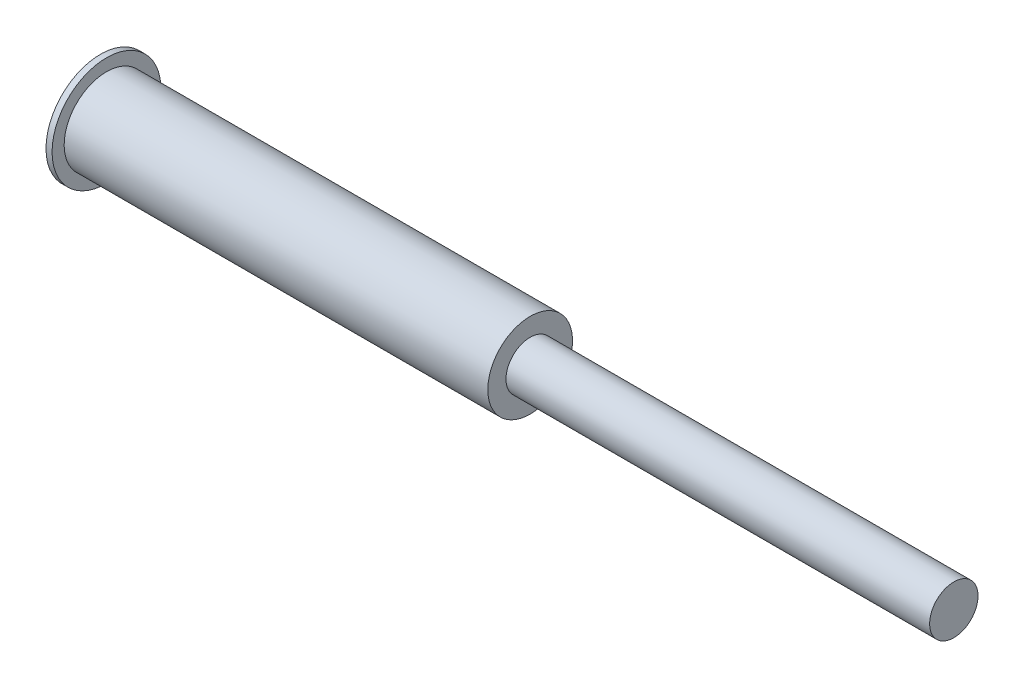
ISO-10303-21;
HEADER;
FILE_DESCRIPTION(('STEP AP214'),'2;1');
FILE_NAME('part.step','',(''),(''),'','','');
FILE_SCHEMA(('AUTOMOTIVE_DESIGN { 1 0 10303 214 1 1 1 1 }'));
ENDSEC;
DATA;
#1=APPLICATION_CONTEXT('core data for automotive mechanical design processes');
#2=APPLICATION_PROTOCOL_DEFINITION('international standard','automotive_design',2000,#1);
#3=PRODUCT_CONTEXT('',#1,'mechanical');
#4=PRODUCT('Part','Part','',(#3));
#5=PRODUCT_RELATED_PRODUCT_CATEGORY('part','',(#4));
#6=PRODUCT_DEFINITION_FORMATION('','',#4);
#7=PRODUCT_DEFINITION_CONTEXT('part definition',#1,'design');
#8=PRODUCT_DEFINITION('design','',#6,#7);
#9=PRODUCT_DEFINITION_SHAPE('','',#8);
#10=(LENGTH_UNIT() NAMED_UNIT(*) SI_UNIT(.MILLI.,.METRE.));
#11=(NAMED_UNIT(*) PLANE_ANGLE_UNIT() SI_UNIT($,.RADIAN.));
#12=(NAMED_UNIT(*) SI_UNIT($,.STERADIAN.) SOLID_ANGLE_UNIT());
#13=UNCERTAINTY_MEASURE_WITH_UNIT(LENGTH_MEASURE(1.E-05),#10,'distance_accuracy_value','');
#14=(GEOMETRIC_REPRESENTATION_CONTEXT(3) GLOBAL_UNCERTAINTY_ASSIGNED_CONTEXT((#13)) GLOBAL_UNIT_ASSIGNED_CONTEXT((#10,
#11,#12)) REPRESENTATION_CONTEXT('',''));
#15=CARTESIAN_POINT('',(0.,0.,0.));
#16=DIRECTION('',(0.,0.,1.));
#17=DIRECTION('',(1.,0.,0.));
#18=AXIS2_PLACEMENT_3D('',#15,#16,#17);
#19=CARTESIAN_POINT('',(0.,4.5,0.));
#20=DIRECTION('',(1.,0.,0.));
#21=DIRECTION('',(0.,0.,-1.));
#22=AXIS2_PLACEMENT_3D('',#19,#20,#21);
#23=PLANE('',#22);
#24=CARTESIAN_POINT('',(0.,0.,0.));
#25=DIRECTION('',(-1.,0.,0.));
#26=DIRECTION('',(0.,0.,1.));
#27=AXIS2_PLACEMENT_3D('',#24,#25,#26);
#28=CIRCLE('',#27,4.5);
#29=CARTESIAN_POINT('',(0.,0.,4.5));
#30=VERTEX_POINT('',#29);
#31=EDGE_CURVE('E10',#30,#30,#28,.T.);
#32=ORIENTED_EDGE('',*,*,#31,.T.);
#33=EDGE_LOOP('',(#32));
#34=FACE_BOUND('',#33,.T.);
#35=ADVANCED_FACE('F39',(#34),#23,.F.);
#36=CARTESIAN_POINT('',(0.,0.,0.));
#37=DIRECTION('',(-1.,0.,0.));
#38=DIRECTION('',(0.,0.,1.));
#39=AXIS2_PLACEMENT_3D('',#36,#37,#38);
#40=CYLINDRICAL_SURFACE('',#39,4.5);
#41=ORIENTED_EDGE('',*,*,#31,.F.);
#42=EDGE_LOOP('',(#41));
#43=FACE_BOUND('',#42,.T.);
#44=CARTESIAN_POINT('',(0.500000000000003,0.,0.));
#45=DIRECTION('',(-1.,0.,0.));
#46=DIRECTION('',(0.,0.,1.));
#47=AXIS2_PLACEMENT_3D('',#44,#45,#46);
#48=CIRCLE('',#47,4.5);
#49=CARTESIAN_POINT('',(0.500000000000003,0.,4.5));
#50=VERTEX_POINT('',#49);
#51=EDGE_CURVE('E44',#50,#50,#48,.T.);
#52=ORIENTED_EDGE('',*,*,#51,.T.);
#53=EDGE_LOOP('',(#52));
#54=FACE_BOUND('',#53,.T.);
#55=ADVANCED_FACE('F80',(#43,#54),#40,.T.);
#56=CARTESIAN_POINT('',(0.500000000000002,3.49999999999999,0.));
#57=DIRECTION('',(-1.,0.,0.));
#58=DIRECTION('',(0.,0.,1.));
#59=AXIS2_PLACEMENT_3D('',#56,#57,#58);
#60=PLANE('',#59);
#61=ORIENTED_EDGE('',*,*,#51,.F.);
#62=EDGE_LOOP('',(#61));
#63=FACE_BOUND('',#62,.T.);
#64=CARTESIAN_POINT('',(0.5,0.,0.));
#65=DIRECTION('',(-1.,0.,0.));
#66=DIRECTION('',(0.,0.,1.));
#67=AXIS2_PLACEMENT_3D('',#64,#65,#66);
#68=CIRCLE('',#67,3.49999999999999);
#69=CARTESIAN_POINT('',(0.5,0.,3.49999999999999));
#70=VERTEX_POINT('',#69);
#71=EDGE_CURVE('E47',#70,#70,#68,.T.);
#72=ORIENTED_EDGE('',*,*,#71,.T.);
#73=EDGE_LOOP('',(#72));
#74=FACE_BOUND('',#73,.T.);
#75=ADVANCED_FACE('F82',(#63,#74),#60,.F.);
#76=CARTESIAN_POINT('',(0.,0.,0.));
#77=DIRECTION('',(-1.,0.,0.));
#78=DIRECTION('',(0.,0.,1.));
#79=AXIS2_PLACEMENT_3D('',#76,#77,#78);
#80=CYLINDRICAL_SURFACE('',#79,3.49999999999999);
#81=ORIENTED_EDGE('',*,*,#71,.F.);
#82=EDGE_LOOP('',(#81));
#83=FACE_BOUND('',#82,.T.);
#84=CARTESIAN_POINT('',(35.5,0.,0.));
#85=DIRECTION('',(-1.,0.,0.));
#86=DIRECTION('',(0.,0.,1.));
#87=AXIS2_PLACEMENT_3D('',#84,#85,#86);
#88=CIRCLE('',#87,3.5);
#89=CARTESIAN_POINT('',(35.5,0.,3.5));
#90=VERTEX_POINT('',#89);
#91=EDGE_CURVE('E52',#90,#90,#88,.T.);
#92=ORIENTED_EDGE('',*,*,#91,.T.);
#93=EDGE_LOOP('',(#92));
#94=FACE_BOUND('',#93,.T.);
#95=ADVANCED_FACE('F88',(#83,#94),#80,.T.);
#96=CARTESIAN_POINT('',(35.5,2.,0.));
#97=DIRECTION('',(-1.,0.,0.));
#98=DIRECTION('',(0.,0.,1.));
#99=AXIS2_PLACEMENT_3D('',#96,#97,#98);
#100=PLANE('',#99);
#101=ORIENTED_EDGE('',*,*,#91,.F.);
#102=EDGE_LOOP('',(#101));
#103=FACE_BOUND('',#102,.T.);
#104=CARTESIAN_POINT('',(35.5,0.,0.));
#105=DIRECTION('',(-1.,0.,0.));
#106=DIRECTION('',(0.,0.,1.));
#107=AXIS2_PLACEMENT_3D('',#104,#105,#106);
#108=CIRCLE('',#107,2.);
#109=CARTESIAN_POINT('',(35.5,0.,2.));
#110=VERTEX_POINT('',#109);
#111=EDGE_CURVE('E59',#110,#110,#108,.T.);
#112=ORIENTED_EDGE('',*,*,#111,.T.);
#113=EDGE_LOOP('',(#112));
#114=FACE_BOUND('',#113,.T.);
#115=ADVANCED_FACE('F71',(#103,#114),#100,.F.);
#116=CARTESIAN_POINT('',(0.,0.,0.));
#117=DIRECTION('',(-1.,0.,0.));
#118=DIRECTION('',(0.,0.,1.));
#119=AXIS2_PLACEMENT_3D('',#116,#117,#118);
#120=CYLINDRICAL_SURFACE('',#119,2.);
#121=ORIENTED_EDGE('',*,*,#111,.F.);
#122=EDGE_LOOP('',(#121));
#123=FACE_BOUND('',#122,.T.);
#124=CARTESIAN_POINT('',(70.5,0.,0.));
#125=DIRECTION('',(-1.,0.,0.));
#126=DIRECTION('',(0.,0.,1.));
#127=AXIS2_PLACEMENT_3D('',#124,#125,#126);
#128=CIRCLE('',#127,2.);
#129=CARTESIAN_POINT('',(70.5,0.,2.));
#130=VERTEX_POINT('',#129);
#131=EDGE_CURVE('E61',#130,#130,#128,.T.);
#132=ORIENTED_EDGE('',*,*,#131,.T.);
#133=EDGE_LOOP('',(#132));
#134=FACE_BOUND('',#133,.T.);
#135=ADVANCED_FACE('F64',(#123,#134),#120,.T.);
#136=CARTESIAN_POINT('',(70.5,2.,0.));
#137=DIRECTION('',(-1.,0.,0.));
#138=DIRECTION('',(0.,0.,1.));
#139=AXIS2_PLACEMENT_3D('',#136,#137,#138);
#140=PLANE('',#139);
#141=ORIENTED_EDGE('',*,*,#131,.F.);
#142=EDGE_LOOP('',(#141));
#143=FACE_BOUND('',#142,.T.);
#144=ADVANCED_FACE('F70',(#143),#140,.F.);
#145=CLOSED_SHELL('',(#35,#55,#75,#95,#115,#135,#144));
#146=MANIFOLD_SOLID_BREP('B2',#145);
#147=ADVANCED_BREP_SHAPE_REPRESENTATION('',(#18,#146),#14);
#148=SHAPE_DEFINITION_REPRESENTATION(#9,#147);
ENDSEC;
END-ISO-10303-21;
